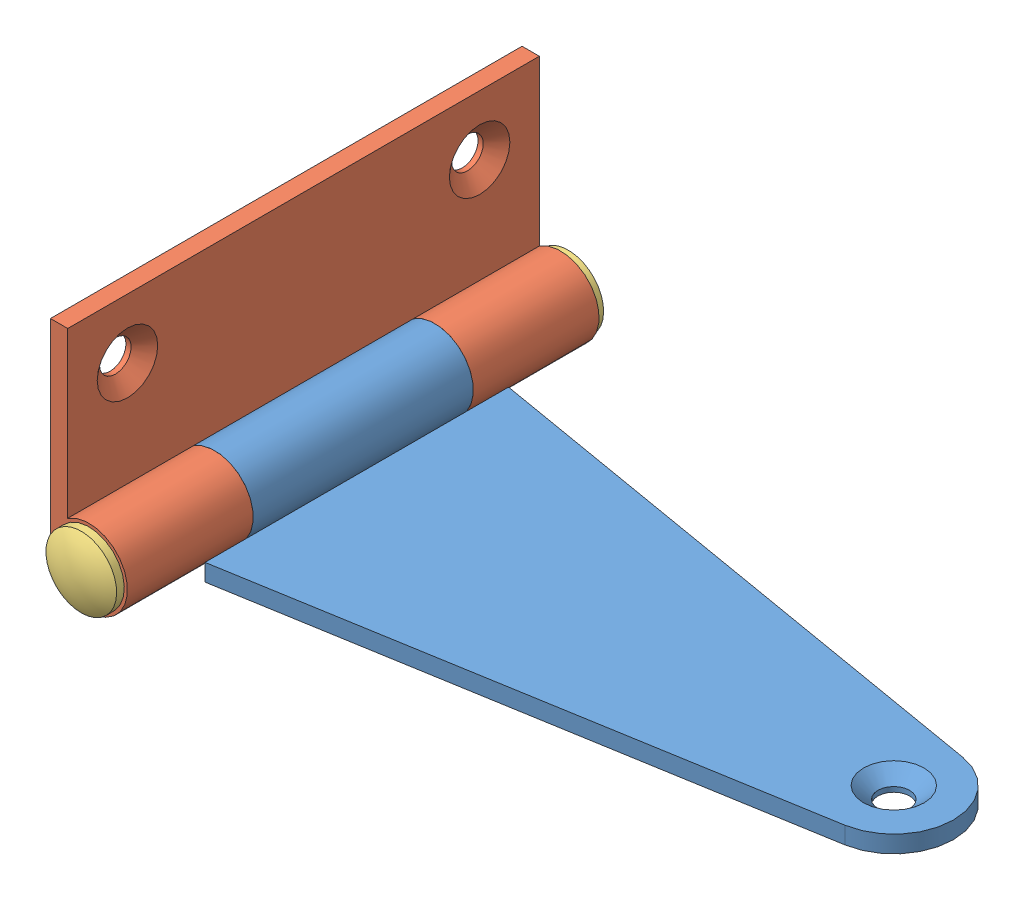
SolidWorks assembly T-Hinge Assembly.SLDASM, configuration Default (file format 9000). Lengths in mm.
Overall size (108.78 58.72 81.82).
3 component instances, 3 part files, 5 mates.
Components (placement in the parent):
- Flange2-1: Flange2.SLDPRT [Default] at (-46.4655 2.0554 -132.6195) x (1 -0.000941 0) z (0 0 1) size (107.82 12.45 49.04)
- Flange1-2: Flange1.SLDPRT [Default] at (-52.6852 5.5164 -132.6195) size (12.45 57.77 76.2)
- Pin-2: Pin.SLDPRT [Default] at (-46.4622 5.5164 -94.5195) x (0 0 -1) z (0.953184 0.30239 0) size (81.82 11.43 11.43)
Mates (geometry in assembly coordinates):
- Concentric4: concentric aligned: cylinder of Pin-2 through (-46.4622 5.5164 -170.7195) axis (0 0 1) radius 4.572; cylinder of Flange1-2 through (-46.4622 5.5164 -170.7195) axis (0 0 1) radius 4.826
- Concentric5: concentric aligned: cylinder of Flange2-1 through (-46.4622 5.5164 -164.0495) axis (0 0 1) radius 4.826; cylinder of Pin-2 through (-46.4622 5.5164 -170.7195) axis (0 0 1) radius 4.572
- Coincident1: coincident aligned: plane of Flange1-2 through (-49.8912 37.2664 -170.7195) normal (0 0 -1); circle of Pin-2
- Coincident2: coincident anti-aligned: plane of Flange2-1 through (-46.4622 5.5164 -150.3995) normal (0 0 -1); plane of Flange1-2 through (-46.4622 5.5164 -150.3995) normal (0 0 1)
- Parallel2: parallel aligned: plane of Flange1-2 through (-49.8912 5.5164 -132.6195) normal (1 0 0); plane of assembly through (0 0 0) normal (1 0 0)
